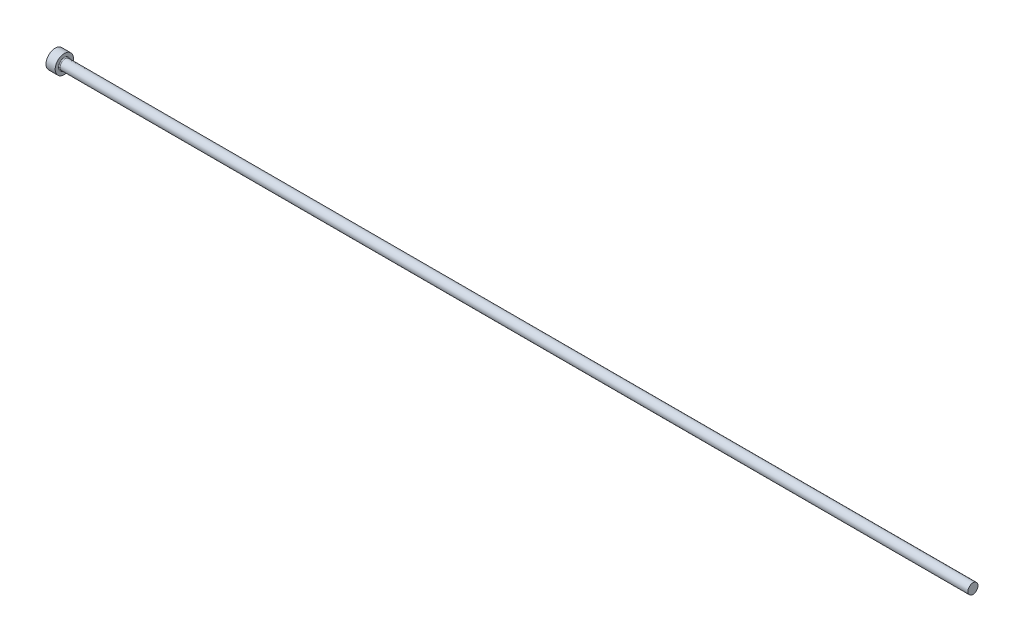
ISO-10303-21;
HEADER;
FILE_DESCRIPTION(('STEP AP214'),'2;1');
FILE_NAME('part.step','',(''),(''),'','','');
FILE_SCHEMA(('AUTOMOTIVE_DESIGN { 1 0 10303 214 1 1 1 1 }'));
ENDSEC;
DATA;
#1=APPLICATION_CONTEXT('core data for automotive mechanical design processes');
#2=APPLICATION_PROTOCOL_DEFINITION('international standard','automotive_design',2000,#1);
#3=PRODUCT_CONTEXT('',#1,'mechanical');
#4=PRODUCT('Part','Part','',(#3));
#5=PRODUCT_RELATED_PRODUCT_CATEGORY('part','',(#4));
#6=PRODUCT_DEFINITION_FORMATION('','',#4);
#7=PRODUCT_DEFINITION_CONTEXT('part definition',#1,'design');
#8=PRODUCT_DEFINITION('design','',#6,#7);
#9=PRODUCT_DEFINITION_SHAPE('','',#8);
#10=(LENGTH_UNIT() NAMED_UNIT(*) SI_UNIT(.MILLI.,.METRE.));
#11=(NAMED_UNIT(*) PLANE_ANGLE_UNIT() SI_UNIT($,.RADIAN.));
#12=(NAMED_UNIT(*) SI_UNIT($,.STERADIAN.) SOLID_ANGLE_UNIT());
#13=UNCERTAINTY_MEASURE_WITH_UNIT(LENGTH_MEASURE(1.E-05),#10,'distance_accuracy_value','');
#14=(GEOMETRIC_REPRESENTATION_CONTEXT(3) GLOBAL_UNCERTAINTY_ASSIGNED_CONTEXT((#13)) GLOBAL_UNIT_ASSIGNED_CONTEXT((#10,
#11,#12)) REPRESENTATION_CONTEXT('',''));
#15=CARTESIAN_POINT('',(0.,0.,0.));
#16=DIRECTION('',(0.,0.,1.));
#17=DIRECTION('',(1.,0.,0.));
#18=AXIS2_PLACEMENT_3D('',#15,#16,#17);
#19=CARTESIAN_POINT('',(0.,0.,0.));
#20=DIRECTION('',(-1.,0.,0.));
#21=DIRECTION('',(0.,-1.,0.));
#22=AXIS2_PLACEMENT_3D('',#19,#20,#21);
#23=PLANE('',#22);
#24=CARTESIAN_POINT('',(0.,0.,0.));
#25=DIRECTION('',(1.,0.,0.));
#26=DIRECTION('',(0.,1.,0.));
#27=AXIS2_PLACEMENT_3D('',#24,#25,#26);
#28=CIRCLE('',#27,2.);
#29=CARTESIAN_POINT('',(0.,2.,0.));
#30=VERTEX_POINT('',#29);
#31=EDGE_CURVE('E25',#30,#30,#28,.T.);
#32=ORIENTED_EDGE('',*,*,#31,.F.);
#33=EDGE_LOOP('',(#32));
#34=FACE_BOUND('',#33,.T.);
#35=ADVANCED_FACE('F14',(#34),#23,.T.);
#36=CARTESIAN_POINT('',(200.,0.,0.));
#37=DIRECTION('',(1.,0.,0.));
#38=DIRECTION('',(0.,1.,0.));
#39=AXIS2_PLACEMENT_3D('',#36,#37,#38);
#40=CYLINDRICAL_SURFACE('',#39,2.);
#41=ORIENTED_EDGE('',*,*,#31,.T.);
#42=EDGE_LOOP('',(#41));
#43=FACE_BOUND('',#42,.T.);
#44=CARTESIAN_POINT('',(2.,0.,0.));
#45=DIRECTION('',(1.,0.,0.));
#46=DIRECTION('',(0.,1.,0.));
#47=AXIS2_PLACEMENT_3D('',#44,#45,#46);
#48=CIRCLE('',#47,2.);
#49=CARTESIAN_POINT('',(2.,2.,0.));
#50=VERTEX_POINT('',#49);
#51=EDGE_CURVE('E29',#50,#50,#48,.T.);
#52=ORIENTED_EDGE('',*,*,#51,.F.);
#53=EDGE_LOOP('',(#52));
#54=FACE_BOUND('',#53,.T.);
#55=ADVANCED_FACE('F51',(#43,#54),#40,.T.);
#56=CARTESIAN_POINT('',(2.,2.,0.));
#57=DIRECTION('',(1.,0.,0.));
#58=DIRECTION('',(0.,1.,0.));
#59=AXIS2_PLACEMENT_3D('',#56,#57,#58);
#60=PLANE('',#59);
#61=CARTESIAN_POINT('',(2.,0.,0.));
#62=DIRECTION('',(1.,0.,0.));
#63=DIRECTION('',(0.,1.,0.));
#64=AXIS2_PLACEMENT_3D('',#61,#62,#63);
#65=CIRCLE('',#64,1.29999999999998);
#66=CARTESIAN_POINT('',(2.,1.29999999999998,0.));
#67=VERTEX_POINT('',#66);
#68=EDGE_CURVE('E9',#67,#67,#65,.F.);
#69=ORIENTED_EDGE('',*,*,#68,.T.);
#70=EDGE_LOOP('',(#69));
#71=FACE_BOUND('',#70,.T.);
#72=ORIENTED_EDGE('',*,*,#51,.T.);
#73=EDGE_LOOP('',(#72));
#74=FACE_BOUND('',#73,.T.);
#75=ADVANCED_FACE('F42',(#71,#74),#60,.T.);
#76=CARTESIAN_POINT('',(200.,0.,0.));
#77=DIRECTION('',(1.,0.,0.));
#78=DIRECTION('',(0.,1.,0.));
#79=AXIS2_PLACEMENT_3D('',#76,#77,#78);
#80=CYLINDRICAL_SURFACE('',#79,1.09999999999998);
#81=CARTESIAN_POINT('',(2.2,0.,0.));
#82=DIRECTION('',(1.,0.,0.));
#83=DIRECTION('',(0.,1.,0.));
#84=AXIS2_PLACEMENT_3D('',#81,#82,#83);
#85=CIRCLE('',#84,1.09999999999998);
#86=CARTESIAN_POINT('',(2.2,1.09999999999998,0.));
#87=VERTEX_POINT('',#86);
#88=EDGE_CURVE('E21',#87,#87,#85,.T.);
#89=ORIENTED_EDGE('',*,*,#88,.T.);
#90=EDGE_LOOP('',(#89));
#91=FACE_BOUND('',#90,.T.);
#92=CARTESIAN_POINT('',(200.,0.,0.));
#93=DIRECTION('',(1.,0.,0.));
#94=DIRECTION('',(0.,1.,0.));
#95=AXIS2_PLACEMENT_3D('',#92,#93,#94);
#96=CIRCLE('',#95,1.09999999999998);
#97=CARTESIAN_POINT('',(200.,1.09999999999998,0.));
#98=VERTEX_POINT('',#97);
#99=EDGE_CURVE('E34',#98,#98,#96,.T.);
#100=ORIENTED_EDGE('',*,*,#99,.F.);
#101=EDGE_LOOP('',(#100));
#102=FACE_BOUND('',#101,.T.);
#103=ADVANCED_FACE('F40',(#91,#102),#80,.T.);
#104=CARTESIAN_POINT('',(200.,1.09999999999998,0.));
#105=DIRECTION('',(1.,0.,0.));
#106=DIRECTION('',(0.,1.,0.));
#107=AXIS2_PLACEMENT_3D('',#104,#105,#106);
#108=PLANE('',#107);
#109=ORIENTED_EDGE('',*,*,#99,.T.);
#110=EDGE_LOOP('',(#109));
#111=FACE_BOUND('',#110,.T.);
#112=ADVANCED_FACE('F38',(#111),#108,.T.);
#113=CARTESIAN_POINT('',(2.2,0.,0.));
#114=DIRECTION('',(1.,0.,0.));
#115=DIRECTION('',(0.,1.,0.));
#116=AXIS2_PLACEMENT_3D('',#113,#114,#115);
#117=TOROIDAL_SURFACE('',#116,1.29999999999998,0.2);
#118=ORIENTED_EDGE('',*,*,#68,.F.);
#119=EDGE_LOOP('',(#118));
#120=FACE_BOUND('',#119,.T.);
#121=ORIENTED_EDGE('',*,*,#88,.F.);
#122=EDGE_LOOP('',(#121));
#123=FACE_BOUND('',#122,.T.);
#124=ADVANCED_FACE('F16',(#120,#123),#117,.F.);
#125=CLOSED_SHELL('',(#35,#55,#75,#103,#112,#124));
#126=MANIFOLD_SOLID_BREP('B1',#125);
#127=ADVANCED_BREP_SHAPE_REPRESENTATION('',(#18,#126),#14);
#128=SHAPE_DEFINITION_REPRESENTATION(#9,#127);
ENDSEC;
END-ISO-10303-21;
